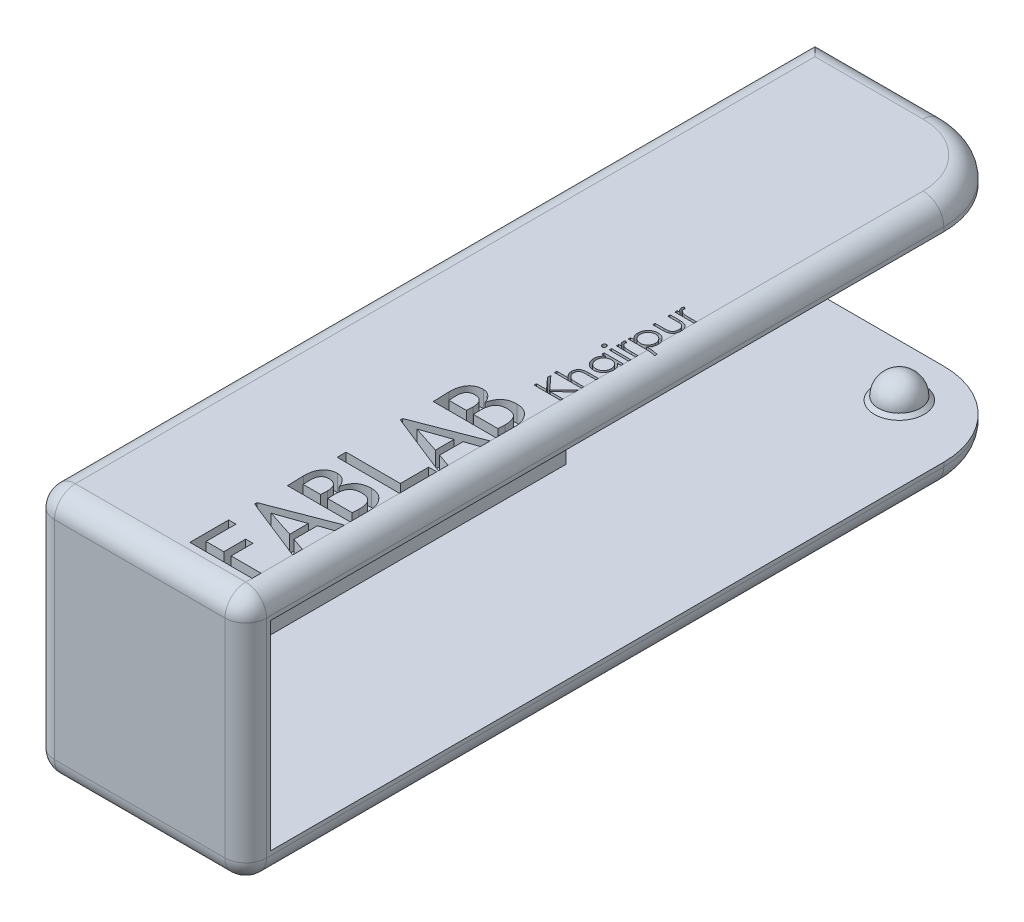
from build123d import *
from build123d.topology import SkipClean

# Parameters (mm, degrees)
SKETCH9_W            = 28.5
SKETCH9_H            = 30
SKETCH9_W_2          = 22.5
SKETCH9_H_2          = 24
EXTRUDE_THIN5_DEPTH  = 91
SKETCH10_W           = 28.5
SKETCH10_H           = 30
BOSS_EXTRUDE3_DEPTH  = 3
SKETCH14_W           = 94
SKETCH14_H           = 30
CUT_EXTRUDE6_DEPTH   = 3
SKETCH16_W           = 32.96402296
SKETCH16_H           = 24
CUT_EXTRUDE8_DEPTH   = 3
SKETCH35_R           = 3
BOSS_EXTRUDE12_DEPTH = 0.4
BOSS_EXTRUDE12_TAPER = 50
REVOLVE6_ANGLE       = 180
FILLET5_R            = 10
FILLET6_R            = 2.5
CUT_REVOLVE12_ANGLE  = 180
SKETCH39_W           = 2.320192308
SKETCH39_H           = 0.284935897
CUT_EXTRUDE12_DEPTH  = 2
SKETCH17_R           = 3
BOSS_EXTRUDE13_DEPTH = 0.4
BOSS_EXTRUDE13_TAPER = 50
REVOLVE8_ANGLE       = 180


with BuildPart() as part:
    # Sketch9 → Extrude-Thin5 (new body)
    with BuildSketch(Plane.XY):
        with Locations((11.25, 12)):
            Rectangle(SKETCH9_W, SKETCH9_H)
        with Locations((11.25, 12)):
            Rectangle(SKETCH9_W_2, SKETCH9_H_2, mode=Mode.SUBTRACT)
    extrude(amount=-EXTRUDE_THIN5_DEPTH)

    # Sketch10 → Boss-Extrude3 (add)
    with BuildSketch(Plane.XY):
        with Locations((11.25, 12)):
            Rectangle(SKETCH10_W, SKETCH10_H)
    extrude(amount=BOSS_EXTRUDE3_DEPTH)

    # Sketch14 → Cut-Extrude6 (cut)
    with BuildSketch(Plane(origin=(25.5, 0, 0), x_dir=(0, 0, -1), z_dir=(1, 0, 0))):
        with Locations((44, 12)):
            Rectangle(SKETCH14_W, SKETCH14_H)
    extrude(amount=-CUT_EXTRUDE6_DEPTH, mode=Mode.SUBTRACT)

    # Sketch16 → Cut-Extrude8 (cut)
    with BuildSketch(Plane(origin=(0, 0, 0), x_dir=(0, 0, -1), z_dir=(1, 0, 0))):
        with Locations((74.51798852, 12)):
            Rectangle(SKETCH16_W, SKETCH16_H)
    extrude(amount=-CUT_EXTRUDE8_DEPTH, mode=Mode.SUBTRACT)

    # Sketch35 → Boss-Extrude12 (add)
    with BuildSketch(Plane.XZ.offset(-24)):
        with Locations((13.35, -84.8)):
            Circle(SKETCH35_R)
    extrude(amount=BOSS_EXTRUDE12_DEPTH, taper=BOSS_EXTRUDE12_TAPER)

    # Sketch36 → Revolve6 (revolve)
    with SkipClean():  # the faces are left unmerged after this step: merging them gives an invalid solid
        with BuildSketch(Plane.XZ.offset(-23.6)):
            with BuildLine():
                ThreePointArc((13.35, -82.276701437), (10.826701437, -84.8), (13.35, -87.323298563))
                Line((13.35, -87.323298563), (13.35, -82.276701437))
            make_face()
            with BuildLine():
                Line((13.35, -82.276701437), (13.35, -87.323298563))
                ThreePointArc((13.35, -87.323298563), (15.134241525, -86.584241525), (15.873298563, -84.8))
                ThreePointArc((15.873298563, -84.8), (15.134241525, -83.015758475), (13.35, -82.276701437))
            make_face()
        revolve(axis=Axis((13.35, 23.6, -87.323298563), (0, 0, 1)), revolution_arc=REVOLVE6_ANGLE)

    # Fillet5
    fillet5_edges = [part.edges().sort_by_distance(p)[0] for p in [
        (22.5, -1.5, -91),
        (22.5, 25.5, -91),
    ]]
    fillet(fillet5_edges, radius=FILLET5_R)

    # Fillet6
    fillet6_edges = [part.edges().sort_by_distance(p)[0] for p in [
        (-3, 12, 3),
        (9.75, -3, 3),
        (9.75, 27, 3),
        (22.5, 12, 3),
        (22.5, -3, -39),
        (-3, 27, -44),
        (-3, -3, -44),
        (-3, 12, -58.03597704),
        (4.75, -3, -91),
        (22.5, 27, -39),
        (19.571067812, -3, -88.071067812),
        (4.75, 27, -91),
        (19.571067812, 27, -88.071067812),
    ]]
    fillet(fillet6_edges, radius=FILLET6_R)

    # Sketch38 → Cut-Revolve12 (revolve, cut)
    with BuildSketch(Plane.XZ.offset(-24)):
        with BuildLine():
            ThreePointArc((16.044289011, -3.396853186), (15.840646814, -1.156789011), (18.080710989, -0.953146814))
            Line((18.080710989, -0.953146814), (16.044289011, -3.396853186))
        make_face()
    revolve(axis=Axis((18.080710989, 24, -0.953146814), (-0.6401843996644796, 0, -0.7682212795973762)), revolution_arc=CUT_REVOLVE12_ANGLE, mode=Mode.SUBTRACT)

    # Sketch39 → Cut-Extrude12 (cut)
    # profile 1 of 15: a face of its own
    with BuildSketch(Plane(origin=(0, 27, 0), x_dir=(1, 0, 0), z_dir=(0, 1, 0))):
        Polygon((13.376623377, 1.350649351), (15.519480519, 1.350649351), (15.519480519, 3.980519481), (16.396103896, 3.980519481), (16.396103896, 1.350649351), (20, 1.350649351), (20, 0.279220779), (12.5, 0.279220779), (12.5, 4.954545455), (13.376623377, 4.954545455), align=None)
    # profile 2 of 15: a face of its own
    with BuildSketch(Plane(origin=(0, 27, 0), x_dir=(1, 0, 0), z_dir=(0, 1, 0))):
        Polygon((20, 10.214285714), (18.441558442, 9.675527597), (18.441558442, 6.864549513), (20, 6.318181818), (20, 5.149350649), (12.402597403, 8.168831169), (12.402597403, 8.461038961), (20, 11.383116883), align=None)
        Polygon((14.350649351, 8.217532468), (17.662337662, 7.132406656), (17.662337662, 9.371144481), align=None, mode=Mode.SUBTRACT)
    # profile 3 of 15: a face of its own
    with BuildSketch(Plane(origin=(0, 27, 0), x_dir=(1, 0, 0), z_dir=(0, 1, 0))):
        with BuildLine():
            Line((20, 14.212357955), (20, 12.064935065))
            Line((20, 12.064935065), (12.469561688, 12.064935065))
            add(Edge.make_bspline(
                [(12.469561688, 12.064935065), (12.464445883, 12.174511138), (12.454593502, 12.385540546), (12.441047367, 12.690436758), (12.428222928, 12.971440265), (12.41971457, 13.22919536), (12.411345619, 13.463029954), (12.407267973, 13.673085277), (12.403918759, 13.85926438), (12.403018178, 13.975445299), (12.402597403, 14.029728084)],
                knots=[0, 0, 0, 0, 1.339051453, 2.578840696, 3.725557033, 4.772779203, 5.726954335, 6.58174599, 7.337354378, 8, 8, 8, 8], degree=3))
            add(Edge.make_bspline(
                [(12.402597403, 14.029728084), (12.404102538, 14.119563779), (12.407023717, 14.293917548), (12.428294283, 14.54764441), (12.464206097, 14.785807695), (12.516293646, 15.00846793), (12.580607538, 15.216323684), (12.662120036, 15.407497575), (12.756215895, 15.584065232), (12.866196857, 15.744096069), (12.989015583, 15.888311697), (13.126836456, 16.011677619), (13.27623691, 16.117017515), (13.438673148, 16.202046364), (13.613531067, 16.270143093), (13.80140843, 16.315853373), (14.001136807, 16.346335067), (14.13847513, 16.349184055), (14.209111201, 16.350649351)],
                knots=[0, 0, 0, 0, 1.293171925, 2.509797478, 3.662491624, 4.7572812, 5.798971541, 6.790532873, 7.744676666, 8.674473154, 9.580681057, 10.46496469, 11.330102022, 12.205626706, 13.09804565, 14.024422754, 14.983917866, 16, 16, 16, 16], degree=3))
            add(Edge.make_bspline(
                [(14.209111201, 16.350649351), (14.251292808, 16.349525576), (14.335040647, 16.34729442), (14.459313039, 16.327888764), (14.581256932, 16.298661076), (14.698938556, 16.252417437), (14.815488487, 16.199180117), (14.926303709, 16.128442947), (15.037176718, 16.050044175), (15.175467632, 15.927198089), (15.332394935, 15.762587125), (15.483867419, 15.547368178), (15.602392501, 15.323323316), (15.644636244, 15.163613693), (15.665584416, 15.084415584)],
                knots=[0, 0, 0, 0, 0.73324583, 1.455794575, 2.183444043, 2.909486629, 3.651546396, 4.40825657, 5.191959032, 6.011265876, 7.621841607, 9.134876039, 10.579218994, 12, 12, 12, 12], degree=3))
            add(Edge.make_bspline(
                [(15.665584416, 15.084415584), (15.68451075, 15.158218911), (15.721493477, 15.302433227), (15.789852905, 15.508922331), (15.867003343, 15.699939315), (15.954633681, 15.874623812), (16.049458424, 16.034847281), (16.155394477, 16.178278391), (16.268200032, 16.307921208), (16.392213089, 16.421347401), (16.527720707, 16.519150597), (16.673028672, 16.604486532), (16.828732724, 16.678759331), (16.99773101, 16.735659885), (17.177394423, 16.781139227), (17.368586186, 16.814737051), (17.571101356, 16.834668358), (17.709978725, 16.836648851), (17.781047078, 16.837662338)],
                knots=[0, 0, 0, 0, 1.208997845, 2.362424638, 3.449441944, 4.475685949, 5.461623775, 6.400508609, 7.301874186, 8.185258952, 9.061385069, 9.949308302, 10.856981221, 11.794034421, 12.774367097, 13.796306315, 14.872293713, 16, 16, 16, 16], degree=3))
            add(Edge.make_bspline(
                [(17.781047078, 16.837662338), (17.863371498, 16.835987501), (18.024749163, 16.832704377), (18.259712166, 16.796062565), (18.482352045, 16.740254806), (18.692488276, 16.661408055), (18.888147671, 16.556241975), (19.072353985, 16.430848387), (19.243619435, 16.282403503), (19.399649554, 16.111473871), (19.540601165, 15.923257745), (19.664735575, 15.720281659), (19.768015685, 15.502605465), (19.854183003, 15.271694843), (19.918549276, 15.026215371), (19.965708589, 14.767284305), (19.99543927, 14.494605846), (19.998457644, 14.307809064), (20, 14.212357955)],
                knots=[0, 0, 0, 0, 1.021251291, 2.00192299, 2.944416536, 3.867325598, 4.780187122, 5.695565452, 6.628732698, 7.587065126, 8.56327736, 9.544050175, 10.535642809, 11.549956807, 12.599500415, 13.681645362, 14.815346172, 16, 16, 16, 16], degree=3))
        make_face()
        with BuildLine():
            Line((13.279220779, 13.136363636), (15.390117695, 13.136363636))
            add(Edge.make_bspline(
                [(15.390117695, 13.136363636), (15.394951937, 13.190624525), (15.405152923, 13.305123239), (15.415563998, 13.485782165), (15.42165637, 13.684717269), (15.421933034, 13.823250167), (15.422077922, 13.895799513)],
                knots=[0, 0, 0, 0, 0.859626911, 1.813943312, 2.855167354, 4, 4, 4, 4], degree=3))
            add(Edge.make_bspline(
                [(15.422077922, 13.895799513), (15.421261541, 13.951633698), (15.419678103, 14.05992868), (15.405786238, 14.217021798), (15.383452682, 14.36359113), (15.351427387, 14.498824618), (15.312151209, 14.624068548), (15.262467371, 14.738114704), (15.201758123, 14.840691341), (15.13584574, 14.935045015), (15.05688608, 15.015988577), (14.969784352, 15.086107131), (14.874171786, 15.146745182), (14.768926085, 15.19473139), (14.655232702, 15.233064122), (14.532411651, 15.260830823), (14.400191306, 15.275039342), (14.309079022, 15.277803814), (14.262378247, 15.279220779)],
                knots=[0, 0, 0, 0, 1.296828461, 2.515305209, 3.660389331, 4.738053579, 5.740607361, 6.706255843, 7.619875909, 8.506259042, 9.373075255, 10.236278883, 11.09948251, 11.995837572, 12.91634841, 13.882715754, 14.914758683, 16, 16, 16, 16], degree=3))
            add(Edge.make_bspline(
                [(14.262378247, 15.279220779), (14.221228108, 15.278553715), (14.141161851, 15.277255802), (14.025116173, 15.261169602), (13.916676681, 15.237801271), (13.816383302, 15.20257301), (13.725322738, 15.156091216), (13.639551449, 15.103130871), (13.56378457, 15.037271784), (13.496571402, 14.961224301), (13.434584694, 14.87766376), (13.383300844, 14.781893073), (13.33903651, 14.677062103), (13.304446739, 14.562074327), (13.277663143, 14.437795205), (13.255110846, 14.303899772), (13.246172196, 14.159207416), (13.243876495, 14.059661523), (13.242694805, 14.008421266)],
                knots=[0, 0, 0, 0, 1.059624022, 2.06172158, 3.013167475, 3.914528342, 4.791479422, 5.643722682, 6.505834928, 7.366756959, 8.255804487, 9.18019209, 10.158646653, 11.184175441, 12.26890402, 13.433779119, 14.679063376, 16, 16, 16, 16], degree=3))
            add(Edge.make_bspline(
                [(13.242694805, 14.008421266), (13.243547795, 13.929281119), (13.245204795, 13.77554513), (13.250293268, 13.551191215), (13.263077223, 13.339655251), (13.273944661, 13.202804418), (13.279220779, 13.136363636)],
                knots=[0, 0, 0, 0, 1.087806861, 2.11315079, 3.083938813, 4, 4, 4, 4], degree=3))
        make_face(mode=Mode.SUBTRACT)
        with BuildLine():
            Line((16.227171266, 13.136363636), (19.169034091, 13.136363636))
            add(Edge.make_bspline(
                [(19.169034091, 13.136363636), (19.176844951, 13.218528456), (19.191445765, 13.372118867), (19.20895339, 13.587671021), (19.218444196, 13.77243648), (19.220051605, 13.885645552), (19.220779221, 13.936891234)],
                knots=[0, 0, 0, 0, 1.234185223, 2.307058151, 3.233666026, 4, 4, 4, 4], degree=3))
            add(Edge.make_bspline(
                [(19.220779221, 13.936891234), (19.219538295, 14.013522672), (19.217135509, 14.161902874), (19.200804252, 14.376472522), (19.172237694, 14.575393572), (19.131627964, 14.757615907), (19.079665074, 14.924307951), (19.016532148, 15.075289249), (18.940243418, 15.210126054), (18.852174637, 15.328994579), (18.752976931, 15.434764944), (18.636757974, 15.522171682), (18.510256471, 15.599967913), (18.367692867, 15.660052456), (18.212557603, 15.709522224), (18.042779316, 15.741066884), (17.860307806, 15.764067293), (17.733950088, 15.765493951), (17.668425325, 15.766233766)],
                knots=[0, 0, 0, 0, 1.32816977, 2.571713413, 3.726913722, 4.808420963, 5.803983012, 6.749560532, 7.639497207, 8.481858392, 9.308983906, 10.142626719, 10.994615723, 11.876699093, 12.81665923, 13.811638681, 14.865191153, 16, 16, 16, 16], degree=3))
            add(Edge.make_bspline(
                [(17.668425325, 15.766233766), (17.608002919, 15.765224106), (17.490362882, 15.763258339), (17.320152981, 15.743537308), (17.162267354, 15.71001276), (17.016949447, 15.664337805), (16.882632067, 15.607109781), (16.762170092, 15.533101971), (16.653200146, 15.44745437), (16.55560089, 15.348973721), (16.470873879, 15.234078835), (16.397961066, 15.102586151), (16.337287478, 14.953142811), (16.287534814, 14.786422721), (16.248096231, 14.602239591), (16.221772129, 14.400677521), (16.204727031, 14.18221151), (16.202470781, 14.030777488), (16.201298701, 13.95211039)],
                knots=[0, 0, 0, 0, 1.076720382, 2.096332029, 3.048766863, 3.949665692, 4.808175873, 5.64409988, 6.461825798, 7.27393223, 8.107701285, 8.998329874, 9.947151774, 10.977017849, 12.096191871, 13.300910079, 14.597874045, 16, 16, 16, 16], degree=3))
            Line((16.201298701, 13.95211039), (16.227171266, 13.136363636))
        make_face(mode=Mode.SUBTRACT)
    # profile 4 of 15: a face of its own
    with BuildSketch(Plane(origin=(0, 27, 0), x_dir=(1, 0, 0), z_dir=(0, 1, 0))):
        Polygon((20, 18.006493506), (12.5, 18.006493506), (12.5, 19.077922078), (19.025974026, 19.077922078), (19.025974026, 22.487012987), (20, 22.487012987), align=None)
    # profile 5 of 15: a face of its own
    with BuildSketch(Plane(origin=(0, 27, 0), x_dir=(1, 0, 0), z_dir=(0, 1, 0))):
        Polygon((20, 27.746753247), (18.441558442, 27.20799513), (18.441558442, 24.397017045), (20, 23.850649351), (20, 22.681818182), (12.402597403, 25.701298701), (12.402597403, 25.993506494), (20, 28.915584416), align=None)
        Polygon((14.350649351, 25.75), (17.662337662, 24.664874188), (17.662337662, 26.903612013), align=None, mode=Mode.SUBTRACT)
    # profile 6 of 15: a face of its own
    with BuildSketch(Plane(origin=(0, 27, 0), x_dir=(1, 0, 0), z_dir=(0, 1, 0))):
        with BuildLine():
            Line((20, 31.744825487), (20, 29.597402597))
            Line((20, 29.597402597), (12.469561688, 29.597402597))
            add(Edge.make_bspline(
                [(12.469561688, 29.597402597), (12.464445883, 29.70697867), (12.454593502, 29.918008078), (12.441047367, 30.22290429), (12.428222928, 30.503907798), (12.41971457, 30.761662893), (12.411345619, 30.995497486), (12.407267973, 31.205552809), (12.403918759, 31.391731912), (12.403018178, 31.507912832), (12.402597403, 31.562195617)],
                knots=[0, 0, 0, 0, 1.339051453, 2.578840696, 3.725557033, 4.772779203, 5.726954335, 6.58174599, 7.337354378, 8, 8, 8, 8], degree=3))
            add(Edge.make_bspline(
                [(12.402597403, 31.562195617), (12.404102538, 31.652031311), (12.407023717, 31.82638508), (12.428294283, 32.080111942), (12.464206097, 32.318275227), (12.516293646, 32.540935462), (12.580607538, 32.748791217), (12.662120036, 32.939965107), (12.756215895, 33.116532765), (12.866196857, 33.276563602), (12.989015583, 33.420779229), (13.126836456, 33.544145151), (13.27623691, 33.649485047), (13.438673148, 33.734513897), (13.613531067, 33.802610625), (13.80140843, 33.848320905), (14.001136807, 33.8788026), (14.13847513, 33.881651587), (14.209111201, 33.883116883)],
                knots=[0, 0, 0, 0, 1.293171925, 2.509797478, 3.662491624, 4.7572812, 5.798971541, 6.790532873, 7.744676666, 8.674473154, 9.580681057, 10.46496469, 11.330102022, 12.205626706, 13.09804565, 14.024422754, 14.983917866, 16, 16, 16, 16], degree=3))
            add(Edge.make_bspline(
                [(14.209111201, 33.883116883), (14.251292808, 33.881993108), (14.335040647, 33.879761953), (14.459313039, 33.860356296), (14.581256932, 33.831128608), (14.698938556, 33.784884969), (14.815488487, 33.73164765), (14.926303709, 33.660910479), (15.037176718, 33.582511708), (15.175467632, 33.459665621), (15.332394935, 33.295054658), (15.483867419, 33.07983571), (15.602392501, 32.855790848), (15.644636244, 32.696081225), (15.665584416, 32.616883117)],
                knots=[0, 0, 0, 0, 0.73324583, 1.455794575, 2.183444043, 2.909486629, 3.651546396, 4.40825657, 5.191959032, 6.011265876, 7.621841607, 9.134876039, 10.579218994, 12, 12, 12, 12], degree=3))
            add(Edge.make_bspline(
                [(15.665584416, 32.616883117), (15.68451075, 32.690686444), (15.721493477, 32.83490076), (15.789852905, 33.041389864), (15.867003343, 33.232406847), (15.954633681, 33.407091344), (16.049458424, 33.567314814), (16.155394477, 33.710745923), (16.268200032, 33.840388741), (16.392213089, 33.953814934), (16.527720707, 34.05161813), (16.673028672, 34.136954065), (16.828732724, 34.211226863), (16.99773101, 34.268127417), (17.177394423, 34.31360676), (17.368586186, 34.347204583), (17.571101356, 34.36713589), (17.709978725, 34.369116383), (17.781047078, 34.37012987)],
                knots=[0, 0, 0, 0, 1.208997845, 2.362424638, 3.449441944, 4.475685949, 5.461623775, 6.400508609, 7.301874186, 8.185258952, 9.061385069, 9.949308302, 10.856981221, 11.794034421, 12.774367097, 13.796306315, 14.872293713, 16, 16, 16, 16], degree=3))
            add(Edge.make_bspline(
                [(17.781047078, 34.37012987), (17.863371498, 34.368455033), (18.024749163, 34.365171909), (18.259712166, 34.328530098), (18.482352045, 34.272722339), (18.692488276, 34.193875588), (18.888147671, 34.088709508), (19.072353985, 33.963315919), (19.243619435, 33.814871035), (19.399649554, 33.643941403), (19.540601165, 33.455725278), (19.664735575, 33.252749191), (19.768015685, 33.035072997), (19.854183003, 32.804162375), (19.918549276, 32.558682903), (19.965708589, 32.299751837), (19.99543927, 32.027073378), (19.998457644, 31.840276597), (20, 31.744825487)],
                knots=[0, 0, 0, 0, 1.021251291, 2.00192299, 2.944416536, 3.867325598, 4.780187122, 5.695565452, 6.628732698, 7.587065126, 8.56327736, 9.544050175, 10.535642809, 11.549956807, 12.599500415, 13.681645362, 14.815346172, 16, 16, 16, 16], degree=3))
        make_face()
        with BuildLine():
            Line((13.279220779, 30.668831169), (15.390117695, 30.668831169))
            add(Edge.make_bspline(
                [(15.390117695, 30.668831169), (15.394951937, 30.723092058), (15.405152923, 30.837590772), (15.415563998, 31.018249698), (15.42165637, 31.217184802), (15.421933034, 31.355717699), (15.422077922, 31.428267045)],
                knots=[0, 0, 0, 0, 0.859626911, 1.813943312, 2.855167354, 4, 4, 4, 4], degree=3))
            add(Edge.make_bspline(
                [(15.422077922, 31.428267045), (15.421261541, 31.48410123), (15.419678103, 31.592396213), (15.405786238, 31.74948933), (15.383452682, 31.896058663), (15.351427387, 32.03129215), (15.312151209, 32.15653608), (15.262467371, 32.270582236), (15.201758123, 32.373158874), (15.13584574, 32.467512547), (15.05688608, 32.54845611), (14.969784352, 32.618574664), (14.874171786, 32.679212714), (14.768926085, 32.727198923), (14.655232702, 32.765531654), (14.532411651, 32.793298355), (14.400191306, 32.807506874), (14.309079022, 32.810271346), (14.262378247, 32.811688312)],
                knots=[0, 0, 0, 0, 1.296828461, 2.515305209, 3.660389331, 4.738053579, 5.740607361, 6.706255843, 7.619875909, 8.506259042, 9.373075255, 10.236278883, 11.09948251, 11.995837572, 12.91634841, 13.882715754, 14.914758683, 16, 16, 16, 16], degree=3))
            add(Edge.make_bspline(
                [(14.262378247, 32.811688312), (14.221228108, 32.811021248), (14.141161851, 32.809723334), (14.025116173, 32.793637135), (13.916676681, 32.770268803), (13.816383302, 32.735040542), (13.725322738, 32.688558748), (13.639551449, 32.635598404), (13.56378457, 32.569739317), (13.496571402, 32.493691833), (13.434584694, 32.410131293), (13.383300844, 32.314360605), (13.33903651, 32.209529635), (13.304446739, 32.09454186), (13.277663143, 31.970262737), (13.255110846, 31.836367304), (13.246172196, 31.691674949), (13.243876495, 31.592129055), (13.242694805, 31.540888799)],
                knots=[0, 0, 0, 0, 1.059624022, 2.06172158, 3.013167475, 3.914528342, 4.791479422, 5.643722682, 6.505834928, 7.366756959, 8.255804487, 9.18019209, 10.158646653, 11.184175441, 12.26890402, 13.433779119, 14.679063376, 16, 16, 16, 16], degree=3))
            add(Edge.make_bspline(
                [(13.242694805, 31.540888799), (13.243547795, 31.461748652), (13.245204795, 31.308012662), (13.250293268, 31.083658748), (13.263077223, 30.872122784), (13.273944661, 30.735271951), (13.279220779, 30.668831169)],
                knots=[0, 0, 0, 0, 1.087806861, 2.11315079, 3.083938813, 4, 4, 4, 4], degree=3))
        make_face(mode=Mode.SUBTRACT)
        with BuildLine():
            Line((16.227171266, 30.668831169), (19.169034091, 30.668831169))
            add(Edge.make_bspline(
                [(19.169034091, 30.668831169), (19.176844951, 30.750995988), (19.191445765, 30.904586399), (19.20895339, 31.120138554), (19.218444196, 31.304904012), (19.220051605, 31.418113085), (19.220779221, 31.469358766)],
                knots=[0, 0, 0, 0, 1.234185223, 2.307058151, 3.233666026, 4, 4, 4, 4], degree=3))
            add(Edge.make_bspline(
                [(19.220779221, 31.469358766), (19.219538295, 31.545990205), (19.217135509, 31.694370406), (19.200804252, 31.908940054), (19.172237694, 32.107861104), (19.131627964, 32.290083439), (19.079665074, 32.456775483), (19.016532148, 32.607756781), (18.940243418, 32.742593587), (18.852174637, 32.861462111), (18.752976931, 32.967232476), (18.636757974, 33.054639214), (18.510256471, 33.132435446), (18.367692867, 33.192519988), (18.212557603, 33.241989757), (18.042779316, 33.273534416), (17.860307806, 33.296534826), (17.733950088, 33.297961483), (17.668425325, 33.298701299)],
                knots=[0, 0, 0, 0, 1.32816977, 2.571713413, 3.726913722, 4.808420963, 5.803983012, 6.749560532, 7.639497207, 8.481858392, 9.308983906, 10.142626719, 10.994615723, 11.876699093, 12.81665923, 13.811638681, 14.865191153, 16, 16, 16, 16], degree=3))
            add(Edge.make_bspline(
                [(17.668425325, 33.298701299), (17.608002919, 33.297691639), (17.490362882, 33.295725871), (17.320152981, 33.276004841), (17.162267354, 33.242480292), (17.016949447, 33.196805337), (16.882632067, 33.139577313), (16.762170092, 33.065569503), (16.653200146, 32.979921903), (16.55560089, 32.881441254), (16.470873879, 32.766546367), (16.397961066, 32.635053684), (16.337287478, 32.485610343), (16.287534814, 32.318890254), (16.248096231, 32.134707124), (16.221772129, 31.933145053), (16.204727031, 31.714679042), (16.202470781, 31.56324502), (16.201298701, 31.484577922)],
                knots=[0, 0, 0, 0, 1.076720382, 2.096332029, 3.048766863, 3.949665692, 4.808175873, 5.64409988, 6.461825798, 7.27393223, 8.107701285, 8.998329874, 9.947151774, 10.977017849, 12.096191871, 13.300910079, 14.597874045, 16, 16, 16, 16], degree=3))
            Line((16.201298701, 31.484577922), (16.227171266, 30.668831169))
        make_face(mode=Mode.SUBTRACT)
    # profile 7 of 15: a face of its own
    with BuildSketch(Plane(origin=(0, 27, 0), x_dir=(1, 0, 0), z_dir=(0, 1, 0))):
        Polygon((16.825, 37.380288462), (16.825, 37.665224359), (18.034069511, 37.665224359), (16.825, 38.988777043), (16.825, 39.395192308), (18.249679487, 37.835041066), (20, 39.517307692), (20, 39.137605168), (18.467833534, 37.665224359), (20, 37.665224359), (20, 37.380288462), align=None)
    # profile 8 of 15: a face of its own
    with BuildSketch(Plane(origin=(0, 27, 0), x_dir=(1, 0, 0), z_dir=(0, 1, 0))):
        with BuildLine():
            Line((16.743589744, 39.90400641), (16.743589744, 40.188942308))
            Line((16.743589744, 40.188942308), (18.118023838, 40.188942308))
            add(Edge.make_bspline(
                [(18.118023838, 40.188942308), (18.079797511, 40.219531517), (18.005368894, 40.279090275), (17.908190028, 40.379287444), (17.824146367, 40.482444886), (17.756355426, 40.591258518), (17.703324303, 40.704778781), (17.666746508, 40.823168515), (17.643423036, 40.945950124), (17.640555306, 41.029440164), (17.639102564, 41.071734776)],
                knots=[0, 0, 0, 0, 1.125633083, 2.191665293, 3.205031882, 4.182434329, 5.134135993, 6.080017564, 7.027370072, 8, 8, 8, 8], degree=3))
            add(Edge.make_bspline(
                [(17.639102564, 41.071734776), (17.640593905, 41.114692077), (17.643514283, 41.198812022), (17.669320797, 41.320829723), (17.709921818, 41.435487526), (17.767569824, 41.541096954), (17.838766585, 41.636519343), (17.921823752, 41.720039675), (18.016753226, 41.789513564), (18.104967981, 41.836063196), (18.183450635, 41.866544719), (18.250798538, 41.885817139), (18.32583767, 41.902164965), (18.408537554, 41.916406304), (18.49929268, 41.925898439), (18.597694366, 41.933522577), (18.70373674, 41.93894409), (18.777142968, 41.939154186), (18.815099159, 41.939262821)],
                knots=[0, 0, 0, 0, 1.235771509, 2.41991536, 3.57472251, 4.727526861, 5.870395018, 6.992794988, 8.106410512, 9.245194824, 9.854018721, 10.52826073, 11.259975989, 12.064917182, 12.943387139, 13.886414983, 14.90712766, 16, 16, 16, 16], degree=3))
            Line((18.815099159, 41.939262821), (20, 41.939262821))
            Line((20, 41.939262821), (20, 41.654326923))
            Line((20, 41.654326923), (18.90859375, 41.654326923))
            add(Edge.make_bspline(
                [(18.90859375, 41.654326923), (18.877004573, 41.654154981), (18.816579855, 41.653826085), (18.730069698, 41.652725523), (18.65181524, 41.650324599), (18.581654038, 41.646301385), (18.519681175, 41.64225309), (18.465795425, 41.636513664), (18.42033483, 41.629885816), (18.392971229, 41.623926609), (18.380699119, 41.621254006)],
                knots=[0, 0, 0, 0, 1.430934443, 2.737134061, 3.918973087, 4.976914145, 5.92044225, 6.731742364, 7.431207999, 8, 8, 8, 8], degree=3))
            add(Edge.make_bspline(
                [(18.380699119, 41.621254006), (18.344664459, 41.610938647), (18.275571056, 41.59115982), (18.181882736, 41.54427009), (18.101287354, 41.487064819), (18.036035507, 41.416170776), (17.98483484, 41.334061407), (17.94940251, 41.239834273), (17.927404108, 41.134442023), (17.92519164, 41.060190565), (17.924038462, 41.021489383)],
                knots=[0, 0, 0, 0, 1.090133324, 2.090238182, 3.036763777, 3.954757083, 4.878717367, 5.838952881, 6.873623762, 8, 8, 8, 8], degree=3))
            add(Edge.make_bspline(
                [(17.924038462, 41.021489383), (17.924463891, 40.998565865), (17.925305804, 40.953200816), (17.933972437, 40.885967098), (17.947660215, 40.820544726), (17.967878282, 40.757109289), (17.992459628, 40.69553139), (18.022625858, 40.63556072), (18.059100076, 40.578018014), (18.100151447, 40.522160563), (18.145565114, 40.470162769), (18.193506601, 40.421788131), (18.244555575, 40.378663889), (18.297895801, 40.339594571), (18.354258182, 40.305868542), (18.413099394, 40.276428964), (18.474496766, 40.251450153), (18.517109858, 40.239037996), (18.53843149, 40.232827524)],
                knots=[0, 0, 0, 0, 1.024369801, 2.02720137, 3.025498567, 4.008789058, 4.999724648, 5.987391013, 7.005161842, 8.042127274, 9.083588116, 10.088924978, 11.084112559, 12.068088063, 13.041783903, 14.016724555, 15.007660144, 16, 16, 16, 16], degree=3))
            add(Edge.make_bspline(
                [(18.53843149, 40.232827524), (18.553871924, 40.229253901), (18.587518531, 40.221466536), (18.643012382, 40.213016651), (18.707497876, 40.205453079), (18.780877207, 40.199059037), (18.863419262, 40.19513738), (18.954560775, 40.19091169), (19.054872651, 40.189338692), (19.124627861, 40.189078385), (19.161092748, 40.188942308)],
                knots=[0, 0, 0, 0, 0.607992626, 1.324890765, 2.152360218, 3.099583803, 4.150613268, 5.323148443, 6.60066238, 8, 8, 8, 8], degree=3))
            Line((19.161092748, 40.188942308), (20, 40.188942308))
            Line((20, 40.188942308), (20, 39.90400641))
            Line((20, 39.90400641), (16.743589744, 39.90400641))
        make_face()
    # profile 9 of 15: a face of its own
    with BuildSketch(Plane(origin=(0, 27, 0), x_dir=(1, 0, 0), z_dir=(0, 1, 0))):
        with BuildLine():
            Line((17.679807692, 44.951442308), (20, 44.951442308))
            Line((20, 44.951442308), (20, 44.66650641))
            Line((20, 44.66650641), (19.598672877, 44.66650641))
            add(Edge.make_bspline(
                [(19.598672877, 44.66650641), (19.63493466, 44.634326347), (19.705805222, 44.57143316), (19.799241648, 44.467379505), (19.87489951, 44.355711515), (19.936891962, 44.239231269), (19.983270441, 44.116797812), (20.016294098, 43.989051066), (20.037511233, 43.855868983), (20.039630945, 43.764926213), (20.040705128, 43.718840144)],
                knots=[0, 0, 0, 0, 1.074325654, 2.099677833, 3.090439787, 4.057542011, 5.018572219, 5.985274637, 6.979019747, 8, 8, 8, 8], degree=3))
            add(Edge.make_bspline(
                [(20.040705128, 43.718840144), (20.039592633, 43.677866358), (20.037398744, 43.597064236), (20.020378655, 43.478202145), (19.993045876, 43.363818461), (19.955035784, 43.253805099), (19.904616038, 43.148873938), (19.844253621, 43.048126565), (19.772370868, 42.952084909), (19.690194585, 42.86221287), (19.600936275, 42.779452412), (19.505735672, 42.706825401), (19.405004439, 42.646270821), (19.300017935, 42.595634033), (19.189967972, 42.556630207), (19.075235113, 42.529439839), (18.955955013, 42.512439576), (18.874729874, 42.510246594), (18.83354367, 42.509134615)],
                knots=[0, 0, 0, 0, 1.033919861, 2.038935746, 3.024066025, 3.998881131, 4.97069526, 5.957263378, 6.95902576, 7.993208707, 9.027059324, 10.027763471, 11.009749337, 11.988697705, 12.965288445, 13.950418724, 14.960734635, 16, 16, 16, 16], degree=3))
            add(Edge.make_bspline(
                [(18.83354367, 42.509134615), (18.793208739, 42.510271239), (18.713468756, 42.512518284), (18.596194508, 42.52925799), (18.483238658, 42.557407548), (18.374964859, 42.596911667), (18.271242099, 42.647568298), (18.17199702, 42.709188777), (18.076956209, 42.781777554), (17.988354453, 42.865463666), (17.906511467, 42.956118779), (17.835383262, 43.053100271), (17.773954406, 43.153995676), (17.725283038, 43.260369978), (17.685904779, 43.370648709), (17.658660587, 43.485813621), (17.642606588, 43.605385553), (17.640281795, 43.686566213), (17.639102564, 43.727744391)],
                knots=[0, 0, 0, 0, 1.020392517, 2.01726096, 2.990465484, 3.961182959, 4.928053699, 5.906110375, 6.912531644, 7.948652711, 8.985773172, 9.998621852, 10.987621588, 11.969261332, 12.953316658, 13.946091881, 14.958173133, 16, 16, 16, 16], degree=3))
            add(Edge.make_bspline(
                [(17.639102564, 43.727744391), (17.640408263, 43.775096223), (17.642968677, 43.867950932), (17.664232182, 44.003788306), (17.700264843, 44.132233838), (17.748940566, 44.254651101), (17.814977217, 44.369355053), (17.895948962, 44.477773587), (17.995203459, 44.577600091), (18.070490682, 44.636358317), (18.109119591, 44.66650641)],
                knots=[0, 0, 0, 0, 1.039007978, 2.037445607, 3.008437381, 3.96246474, 4.921201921, 5.904967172, 6.925065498, 8, 8, 8, 8], degree=3))
            Line((18.109119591, 44.66650641), (17.679807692, 44.66650641))
            Line((17.679807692, 44.66650641), (17.679807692, 44.951442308))
        make_face()
        with BuildLine():
            add(Edge.make_bspline(
                [(17.924038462, 43.731560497), (17.925521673, 43.68991053), (17.928449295, 43.607700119), (17.95126691, 43.48699724), (17.989331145, 43.371554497), (18.041083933, 43.261551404), (18.107394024, 43.160055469), (18.185519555, 43.067754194), (18.276779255, 42.987493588), (18.377907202, 42.91846966), (18.486920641, 42.863058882), (18.600840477, 42.823848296), (18.717695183, 42.798036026), (18.796944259, 42.795395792), (18.836723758, 42.794070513)],
                knots=[0, 0, 0, 0, 1.031130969, 2.035288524, 3.029955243, 4.035265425, 5.037320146, 6.024362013, 7.021230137, 8.037832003, 9.049975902, 10.039737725, 11.016035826, 12, 12, 12, 12], degree=3))
            add(Edge.make_bspline(
                [(18.836723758, 42.794070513), (18.876263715, 42.795769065), (18.955188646, 42.79915951), (19.072033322, 42.823283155), (19.185697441, 42.86428558), (19.295586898, 42.919621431), (19.397702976, 42.989457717), (19.490601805, 43.06964199), (19.569949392, 43.16238735), (19.636419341, 43.264790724), (19.690079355, 43.374209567), (19.727424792, 43.48926339), (19.751534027, 43.607805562), (19.754350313, 43.688407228), (19.755769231, 43.729016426)],
                knots=[0, 0, 0, 0, 0.979154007, 1.954470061, 2.941101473, 3.965068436, 4.993389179, 5.998216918, 6.996159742, 8.005560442, 9.015493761, 10.005250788, 10.994993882, 12, 12, 12, 12], degree=3))
            add(Edge.make_bspline(
                [(19.755769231, 43.729016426), (19.75424601, 43.770237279), (19.751216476, 43.852221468), (19.728527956, 43.97341723), (19.689621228, 44.090629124), (19.63733461, 44.20305758), (19.572210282, 44.307691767), (19.495967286, 44.401284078), (19.407906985, 44.481359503), (19.31000334, 44.548028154), (19.203356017, 44.600899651), (19.089927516, 44.639558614), (18.969487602, 44.662161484), (18.887064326, 44.665038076), (18.844991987, 44.66650641)],
                knots=[0, 0, 0, 0, 1.01787422, 2.024450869, 3.03297362, 4.061474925, 5.080076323, 6.069755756, 7.033548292, 8.009625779, 8.9862229, 9.964937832, 10.961217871, 12, 12, 12, 12], degree=3))
            add(Edge.make_bspline(
                [(18.844991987, 44.66650641), (18.812935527, 44.665635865), (18.749838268, 44.663922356), (18.65719402, 44.650831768), (18.568535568, 44.63000837), (18.4837697, 44.600665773), (18.403365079, 44.562120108), (18.326744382, 44.515631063), (18.254306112, 44.46038112), (18.187047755, 44.397259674), (18.125700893, 44.328166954), (18.070941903, 44.255056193), (18.025957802, 44.177061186), (17.988727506, 44.095493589), (17.959100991, 44.010211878), (17.93933644, 43.920522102), (17.925765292, 43.827377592), (17.924620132, 43.763835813), (17.924038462, 43.731560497)],
                knots=[0, 0, 0, 0, 1.050140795, 2.067009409, 3.05949893, 4.030605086, 5.00011959, 5.97591094, 6.962425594, 7.979863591, 8.993523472, 9.986985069, 10.967611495, 11.937549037, 12.921786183, 13.919465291, 14.943216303, 16, 16, 16, 16], degree=3))
        make_face(mode=Mode.SUBTRACT)
    # profile 10 of 15: a face of its own
    with BuildSketch(Plane(origin=(0, 27, 0), x_dir=(1, 0, 0), z_dir=(0, 1, 0))):
        with BuildLine():
            add(Edge.make_bspline(
                [(16.702884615, 45.703215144), (16.703704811, 45.720896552), (16.705310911, 45.755520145), (16.719064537, 45.805588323), (16.742377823, 45.851178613), (16.773655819, 45.891616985), (16.810439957, 45.926316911), (16.853312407, 45.950610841), (16.899629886, 45.966224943), (16.93193786, 45.968110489), (16.94838742, 45.969070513)],
                knots=[0, 0, 0, 0, 1.055194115, 2.066272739, 3.074728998, 4.095836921, 5.109056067, 6.073838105, 7.019297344, 8, 8, 8, 8], degree=3))
            add(Edge.make_bspline(
                [(16.94838742, 45.969070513), (16.96440997, 45.968088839), (16.996084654, 45.966148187), (17.041599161, 45.950622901), (17.083875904, 45.926109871), (17.120588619, 45.891639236), (17.151849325, 45.851172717), (17.175167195, 45.80558989), (17.188919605, 45.755519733), (17.190525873, 45.720896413), (17.191346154, 45.703215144)],
                knots=[0, 0, 0, 0, 0.96129708, 1.900370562, 2.859976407, 3.87933698, 4.906634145, 5.921202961, 6.938410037, 8, 8, 8, 8], degree=3))
            add(Edge.make_bspline(
                [(17.191346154, 45.703215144), (17.190557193, 45.685736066), (17.189021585, 45.651715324), (17.174897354, 45.602396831), (17.151841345, 45.557195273), (17.120793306, 45.516678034), (17.083650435, 45.482904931), (17.041624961, 45.458322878), (16.996078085, 45.442833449), (16.964407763, 45.440887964), (16.94838742, 45.439903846)],
                knots=[0, 0, 0, 0, 1.054934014, 2.053291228, 3.073705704, 4.106921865, 5.123545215, 6.088680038, 7.033164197, 8, 8, 8, 8], degree=3))
            add(Edge.make_bspline(
                [(16.94838742, 45.439903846), (16.931940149, 45.440866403), (16.899636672, 45.442756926), (16.853286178, 45.458334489), (16.810667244, 45.482700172), (16.773451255, 45.516700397), (16.742385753, 45.557189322), (16.719334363, 45.602398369), (16.705208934, 45.651714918), (16.703673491, 45.685735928), (16.702884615, 45.703215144)],
                knots=[0, 0, 0, 0, 0.98631895, 1.937192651, 2.907499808, 3.917963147, 4.944918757, 5.95915025, 6.951458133, 8, 8, 8, 8], degree=3))
        make_face()
    # profile 11 of 15: a face of its own
    with BuildSketch(Plane(origin=(0, 27, 0), x_dir=(1, 0, 0), z_dir=(0, 1, 0))):
        with Locations((18.839903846, 45.70448718)):
            Rectangle(SKETCH39_W, SKETCH39_H)
    # profile 12 of 15: a face of its own
    with BuildSketch(Plane(origin=(0, 27, 0), x_dir=(1, 0, 0), z_dir=(0, 1, 0))):
        with BuildLine():
            Line((17.679807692, 46.416826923), (17.679807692, 46.701762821))
            Line((17.679807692, 46.701762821), (18.021349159, 46.701762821))
            add(Edge.make_bspline(
                [(18.021349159, 46.701762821), (17.989534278, 46.722784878), (17.928688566, 46.762989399), (17.848324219, 46.830126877), (17.781025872, 46.898162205), (17.728076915, 46.968881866), (17.688060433, 47.041592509), (17.659942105, 47.115681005), (17.642505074, 47.191328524), (17.640238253, 47.242287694), (17.639102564, 47.26781851)],
                knots=[0, 0, 0, 0, 1.280091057, 2.448164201, 3.510831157, 4.48793739, 5.405868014, 6.289422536, 7.142991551, 8, 8, 8, 8], degree=3))
            add(Edge.make_bspline(
                [(17.639102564, 47.26781851), (17.640182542, 47.287618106), (17.642404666, 47.328357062), (17.658017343, 47.390026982), (17.682943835, 47.453566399), (17.706384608, 47.494516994), (17.718604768, 47.515865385)],
                knots=[0, 0, 0, 0, 0.901110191, 1.854092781, 2.881294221, 4, 4, 4, 4], degree=3))
            Line((17.718604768, 47.515865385), (17.965379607, 47.359405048))
            add(Edge.make_bspline(
                [(17.965379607, 47.359405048), (17.959265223, 47.345699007), (17.947658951, 47.319682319), (17.933922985, 47.281623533), (17.925834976, 47.246534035), (17.924609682, 47.224178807), (17.924038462, 47.213757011)],
                knots=[0, 0, 0, 0, 1.180555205, 2.24091978, 3.179933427, 4, 4, 4, 4], degree=3))
            add(Edge.make_bspline(
                [(17.924038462, 47.213757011), (17.92555056, 47.190884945), (17.928634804, 47.14423256), (17.95322805, 47.07596885), (17.991820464, 47.00913476), (18.035765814, 46.956567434), (18.077979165, 46.915721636), (18.114925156, 46.886346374), (18.1567361, 46.859981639), (18.201795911, 46.834407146), (18.251235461, 46.810646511), (18.305135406, 46.789412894), (18.363050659, 46.769555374), (18.403320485, 46.758372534), (18.423948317, 46.752644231)],
                knots=[0, 0, 0, 0, 1.125322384, 2.295331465, 3.535939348, 4.916963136, 5.656144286, 6.429838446, 7.238666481, 8.090384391, 8.983239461, 9.940052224, 10.944811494, 12, 12, 12, 12], degree=3))
            add(Edge.make_bspline(
                [(18.423948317, 46.752644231), (18.442341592, 46.748343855), (18.483285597, 46.738771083), (18.551663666, 46.729711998), (18.632398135, 46.720400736), (18.725582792, 46.714042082), (18.831575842, 46.708035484), (18.949920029, 46.704717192), (19.080940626, 46.701868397), (19.172326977, 46.701799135), (19.220242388, 46.701762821)],
                knots=[0, 0, 0, 0, 0.566841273, 1.261806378, 2.068780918, 3.007109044, 4.065315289, 5.256255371, 6.561408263, 8, 8, 8, 8], degree=3))
            Line((19.220242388, 46.701762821), (20, 46.701762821))
            Line((20, 46.701762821), (20, 46.416826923))
            Line((20, 46.416826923), (17.679807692, 46.416826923))
        make_face()
    # profile 13 of 15: a face of its own
    with BuildSketch(Plane(origin=(0, 27, 0), x_dir=(1, 0, 0), z_dir=(0, 1, 0))):
        with BuildLine():
            Line((17.679807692, 47.84150641), (17.679807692, 48.126442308))
            Line((17.679807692, 48.126442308), (18.109119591, 48.126442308))
            add(Edge.make_bspline(
                [(18.109119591, 48.126442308), (18.070468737, 48.156789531), (17.9951201, 48.2159505), (17.896362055, 48.316374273), (17.814758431, 48.424270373), (17.748964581, 48.538958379), (17.700376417, 48.661166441), (17.664216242, 48.789147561), (17.642971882, 48.924359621), (17.640409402, 49.016792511), (17.639102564, 49.063932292)],
                knots=[0, 0, 0, 0, 1.07939028, 2.104237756, 3.085658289, 4.045737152, 5.001099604, 5.968961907, 6.964192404, 8, 8, 8, 8], degree=3))
            add(Edge.make_bspline(
                [(17.639102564, 49.063932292), (17.640293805, 49.10510896), (17.642648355, 49.186496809), (17.658589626, 49.306297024), (17.685910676, 49.421663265), (17.725281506, 49.531942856), (17.773954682, 49.638317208), (17.835383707, 49.739211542), (17.906509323, 49.83619741), (17.988362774, 49.926835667), (18.076925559, 50.010584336), (18.172195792, 50.083016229), (18.271040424, 50.145492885), (18.374991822, 50.195993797), (18.483231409, 50.235552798), (18.596196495, 50.263687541), (18.713468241, 50.280431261), (18.793208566, 50.282677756), (18.83354367, 50.283814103)],
                knots=[0, 0, 0, 0, 1.041296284, 2.058176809, 3.050446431, 4.034000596, 5.01514041, 6.003636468, 7.015969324, 8.052561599, 9.08815499, 10.094063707, 11.074456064, 12.040834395, 13.011057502, 13.983766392, 14.980127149, 16, 16, 16, 16], degree=3))
            add(Edge.make_bspline(
                [(18.83354367, 50.283814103), (18.87473005, 50.282702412), (18.955955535, 50.280509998), (19.075233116, 50.2635056), (19.189975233, 50.236330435), (19.299991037, 50.197270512), (19.405204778, 50.146795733), (19.50554058, 50.085378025), (19.600966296, 50.012909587), (19.690186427, 49.930086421), (19.772372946, 49.840231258), (19.844253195, 49.744185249), (19.904615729, 49.643438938), (19.955037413, 49.538507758), (19.993039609, 49.428493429), (20.020451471, 49.313909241), (20.037355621, 49.19481758), (20.039580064, 49.113808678), (20.040705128, 49.072836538)],
                knots=[0, 0, 0, 0, 1.038740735, 2.04854663, 3.033179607, 4.009277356, 4.987731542, 5.972001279, 6.972200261, 8.005528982, 9.039189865, 10.040446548, 11.026516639, 11.997840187, 12.972163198, 13.956796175, 14.96660207, 16, 16, 16, 16], degree=3))
            add(Edge.make_bspline(
                [(20.040705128, 49.072836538), (20.039438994, 49.026746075), (20.036938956, 48.935738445), (20.014749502, 48.802297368), (19.97830605, 48.674452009), (19.927197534, 48.552577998), (19.861557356, 48.436335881), (19.781654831, 48.326184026), (19.687503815, 48.221577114), (19.616083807, 48.158613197), (19.579592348, 48.126442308)],
                knots=[0, 0, 0, 0, 1.014661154, 2.003492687, 2.970165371, 3.937187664, 4.907406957, 5.904113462, 6.929124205, 8, 8, 8, 8], degree=3))
            Line((19.579592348, 48.126442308), (20.854807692, 48.126442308))
            Line((20.854807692, 48.126442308), (20.854807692, 47.84150641))
            Line((20.854807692, 47.84150641), (17.679807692, 47.84150641))
        make_face()
        with BuildLine():
            add(Edge.make_bspline(
                [(17.924038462, 49.061388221), (17.924619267, 49.029112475), (17.925762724, 48.965569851), (17.939346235, 48.87243148), (17.959065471, 48.7827192), (17.988921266, 48.697337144), (18.025568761, 48.615466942), (18.071363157, 48.537739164), (18.125476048, 48.46420837), (18.186870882, 48.395059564), (18.254520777, 48.332590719), (18.32671829, 48.277288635), (18.403371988, 48.230836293), (18.483767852, 48.192280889), (18.568536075, 48.162940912), (18.65719388, 48.142116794), (18.749838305, 48.129026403), (18.812935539, 48.127312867), (18.844991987, 48.126442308)],
                knots=[0, 0, 0, 0, 1.05670511, 2.080379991, 3.077984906, 4.06214886, 5.038337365, 6.01289324, 7.01187578, 8.025460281, 9.038092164, 10.024533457, 11.000252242, 11.969694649, 12.940728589, 13.933144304, 14.949937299, 16, 16, 16, 16], degree=3))
            add(Edge.make_bspline(
                [(18.844991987, 48.126442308), (18.887071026, 48.127891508), (18.969507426, 48.130730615), (19.089785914, 48.15359157), (19.203504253, 48.19121467), (19.309922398, 48.244407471), (19.408380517, 48.310852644), (19.495516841, 48.392362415), (19.572472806, 48.485906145), (19.637291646, 48.591221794), (19.689658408, 48.704225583), (19.728332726, 48.821703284), (19.751287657, 48.942830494), (19.754267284, 49.024615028), (19.755769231, 49.065840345)],
                knots=[0, 0, 0, 0, 1.037533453, 2.032615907, 3.008487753, 3.983910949, 4.958815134, 5.928528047, 6.917017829, 7.938835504, 8.970843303, 9.983125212, 10.983349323, 12, 12, 12, 12], degree=3))
            add(Edge.make_bspline(
                [(19.755769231, 49.065840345), (19.754357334, 49.106240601), (19.751554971, 49.186427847), (19.727300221, 49.304500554), (19.690245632, 49.419242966), (19.636225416, 49.528273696), (19.56998001, 49.630582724), (19.490568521, 49.723265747), (19.397897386, 49.803558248), (19.295395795, 49.872647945), (19.185582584, 49.927882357), (19.072168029, 49.969839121), (18.955172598, 49.993742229), (18.876258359, 49.997163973), (18.836723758, 49.998878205)],
                knots=[0, 0, 0, 0, 1.001123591, 1.987050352, 2.978152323, 3.984730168, 4.995502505, 5.994801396, 7.000994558, 8.027767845, 9.053126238, 10.042874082, 11.019515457, 12, 12, 12, 12], degree=3))
            add(Edge.make_bspline(
                [(18.836723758, 49.998878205), (18.796941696, 49.997557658), (18.717687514, 49.994926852), (18.600871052, 49.969043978), (18.486711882, 49.930075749), (18.378295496, 49.873606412), (18.276555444, 49.805586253), (18.185554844, 49.725139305), (18.10738445, 49.632908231), (18.041086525, 49.531393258), (17.989330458, 49.421395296), (17.951267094, 49.30595119), (17.928449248, 49.185248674), (17.925521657, 49.103038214), (17.924038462, 49.061388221)],
                knots=[0, 0, 0, 0, 0.984010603, 1.960354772, 2.950163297, 3.964735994, 4.97843856, 5.975353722, 6.962442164, 7.964544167, 8.969901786, 9.964615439, 10.968820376, 12, 12, 12, 12], degree=3))
        make_face(mode=Mode.SUBTRACT)
    # profile 14 of 15: a face of its own
    with BuildSketch(Plane(origin=(0, 27, 0), x_dir=(1, 0, 0), z_dir=(0, 1, 0))):
        with BuildLine():
            Line((17.679807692, 50.812980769), (17.679807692, 51.097916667))
            Line((17.679807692, 51.097916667), (18.755949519, 51.097916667))
            add(Edge.make_bspline(
                [(18.755949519, 51.097916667), (18.787538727, 51.098045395), (18.847967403, 51.098291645), (18.934921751, 51.099961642), (19.014221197, 51.103889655), (19.085911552, 51.108800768), (19.149980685, 51.11511642), (19.206204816, 51.122630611), (19.25522154, 51.131029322), (19.284743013, 51.139250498), (19.298472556, 51.143073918)],
                knots=[0, 0, 0, 0, 1.388932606, 2.656963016, 3.823490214, 4.879454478, 5.816252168, 6.653371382, 7.373723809, 8, 8, 8, 8], degree=3))
            add(Edge.make_bspline(
                [(19.298472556, 51.143073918), (19.315729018, 51.149207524), (19.349883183, 51.161347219), (19.399221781, 51.183366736), (19.444919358, 51.210606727), (19.488738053, 51.240415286), (19.529379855, 51.274795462), (19.566776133, 51.313312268), (19.602339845, 51.354676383), (19.644417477, 51.416139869), (19.689516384, 51.50019506), (19.728429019, 51.610551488), (19.75168437, 51.730207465), (19.754382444, 51.812906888), (19.755769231, 51.855413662)],
                knots=[0, 0, 0, 0, 0.725840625, 1.436591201, 2.137033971, 2.831655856, 3.53531722, 4.242432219, 4.957935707, 5.694543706, 7.190802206, 8.724350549, 10.316345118, 12, 12, 12, 12], degree=3))
            add(Edge.make_bspline(
                [(19.755769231, 51.855413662), (19.754352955, 51.897916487), (19.751612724, 51.980151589), (19.729130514, 52.098492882), (19.691569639, 52.206670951), (19.639130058, 52.303600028), (19.574956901, 52.388840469), (19.499656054, 52.459873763), (19.415609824, 52.518481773), (19.352904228, 52.544071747), (19.321369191, 52.556941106)],
                knots=[0, 0, 0, 0, 1.157059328, 2.238695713, 3.266970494, 4.264342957, 5.228770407, 6.160125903, 7.074715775, 8, 8, 8, 8], degree=3))
            add(Edge.make_bspline(
                [(19.321369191, 52.556941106), (19.308699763, 52.560745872), (19.280690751, 52.56915728), (19.233174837, 52.578194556), (19.176510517, 52.586335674), (19.110326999, 52.59328727), (19.034797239, 52.598244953), (18.949944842, 52.60091742), (18.856036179, 52.603936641), (18.790297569, 52.603982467), (18.755949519, 52.60400641)],
                knots=[0, 0, 0, 0, 0.557542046, 1.232589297, 2.036731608, 2.971723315, 4.038036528, 5.22795436, 6.551621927, 8, 8, 8, 8], degree=3))
            Line((18.755949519, 52.60400641), (17.679807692, 52.60400641))
            Line((17.679807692, 52.60400641), (17.679807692, 52.888942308))
            Line((17.679807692, 52.888942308), (18.809375, 52.888942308))
            add(Edge.make_bspline(
                [(18.809375, 52.888942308), (18.847753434, 52.888540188), (18.922212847, 52.88776002), (19.030423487, 52.882783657), (19.131462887, 52.874126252), (19.225021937, 52.861325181), (19.311122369, 52.845795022), (19.389793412, 52.826159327), (19.461137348, 52.802581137), (19.526219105, 52.776000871), (19.585221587, 52.74458912), (19.641240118, 52.711196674), (19.69279366, 52.672566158), (19.742670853, 52.632248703), (19.787385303, 52.586345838), (19.830480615, 52.53838885), (19.869197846, 52.48574099), (19.904820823, 52.429930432), (19.936765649, 52.370431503), (19.964874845, 52.307388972), (19.988283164, 52.240548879), (20.007361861, 52.169935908), (20.022601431, 52.095824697), (20.033271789, 52.018064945), (20.039832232, 51.936726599), (20.040409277, 51.881291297), (20.040705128, 51.852869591)],
                knots=[0, 0, 0, 0, 1.493202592, 2.897017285, 4.213619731, 5.437335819, 6.569830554, 7.616136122, 8.589086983, 9.491357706, 10.347307, 11.187612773, 12.025729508, 12.851620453, 13.679855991, 14.515574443, 15.358588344, 16.218977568, 17.089938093, 17.983570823, 18.901874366, 19.842360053, 20.827541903, 21.843594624, 22.894409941, 24, 24, 24, 24], degree=3))
            add(Edge.make_bspline(
                [(20.040705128, 51.852869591), (20.040397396, 51.824660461), (20.039792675, 51.769226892), (20.033307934, 51.687884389), (20.022618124, 51.6099091), (20.00725029, 51.535622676), (19.988421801, 51.4647257), (19.964730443, 51.397562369), (19.936769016, 51.334047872), (19.904959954, 51.274045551), (19.869132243, 51.217754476), (19.829699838, 51.165301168), (19.787691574, 51.115750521), (19.741674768, 51.070477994), (19.691993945, 51.029151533), (19.638872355, 50.991591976), (19.582910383, 50.957156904), (19.522980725, 50.92599482), (19.457147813, 50.89922321), (19.384306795, 50.875587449), (19.303659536, 50.856255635), (19.215274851, 50.840523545), (19.119575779, 50.827867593), (19.016008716, 50.819080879), (18.904825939, 50.814167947), (18.828036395, 50.813385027), (18.788386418, 50.812980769)],
                knots=[0, 0, 0, 0, 1.083759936, 2.129689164, 3.133164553, 4.10615121, 5.04285688, 5.949793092, 6.839814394, 7.707177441, 8.556916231, 9.400895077, 10.227072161, 11.05083587, 11.877976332, 12.707560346, 13.548664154, 14.401248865, 15.299878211, 16.27626931, 17.341250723, 18.483766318, 19.724630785, 21.049282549, 22.476408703, 24, 24, 24, 24], degree=3))
            Line((18.788386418, 50.812980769), (17.679807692, 50.812980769))
        make_face()
    # profile 15 of 15: a face of its own
    with BuildSketch(Plane(origin=(0, 27, 0), x_dir=(1, 0, 0), z_dir=(0, 1, 0))):
        with BuildLine():
            Line((17.679807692, 53.458814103), (17.679807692, 53.74375))
            Line((17.679807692, 53.74375), (18.021349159, 53.74375))
            add(Edge.make_bspline(
                [(18.021349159, 53.74375), (17.989534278, 53.764772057), (17.928688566, 53.804976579), (17.848324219, 53.872114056), (17.781025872, 53.940149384), (17.728076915, 54.010869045), (17.688060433, 54.083579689), (17.659942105, 54.157668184), (17.642505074, 54.233315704), (17.640238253, 54.284274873), (17.639102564, 54.309805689)],
                knots=[0, 0, 0, 0, 1.280091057, 2.448164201, 3.510831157, 4.48793739, 5.405868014, 6.289422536, 7.142991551, 8, 8, 8, 8], degree=3))
            add(Edge.make_bspline(
                [(17.639102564, 54.309805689), (17.640182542, 54.329605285), (17.642404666, 54.370344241), (17.658017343, 54.432014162), (17.682943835, 54.495553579), (17.706384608, 54.536504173), (17.718604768, 54.557852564)],
                knots=[0, 0, 0, 0, 0.901110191, 1.854092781, 2.881294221, 4, 4, 4, 4], degree=3))
            Line((17.718604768, 54.557852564), (17.965379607, 54.401392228))
            add(Edge.make_bspline(
                [(17.965379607, 54.401392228), (17.959265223, 54.387686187), (17.947658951, 54.361669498), (17.933922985, 54.323610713), (17.925834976, 54.288521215), (17.924609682, 54.266165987), (17.924038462, 54.255744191)],
                knots=[0, 0, 0, 0, 1.180555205, 2.24091978, 3.179933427, 4, 4, 4, 4], degree=3))
            add(Edge.make_bspline(
                [(17.924038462, 54.255744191), (17.92555056, 54.232872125), (17.928634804, 54.18621974), (17.95322805, 54.11795603), (17.991820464, 54.05112194), (18.035765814, 53.998554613), (18.077979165, 53.957708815), (18.114925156, 53.928333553), (18.1567361, 53.901968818), (18.201795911, 53.876394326), (18.251235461, 53.852633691), (18.305135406, 53.831400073), (18.363050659, 53.811542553), (18.403320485, 53.800359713), (18.423948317, 53.79463141)],
                knots=[0, 0, 0, 0, 1.125322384, 2.295331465, 3.535939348, 4.916963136, 5.656144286, 6.429838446, 7.238666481, 8.090384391, 8.983239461, 9.940052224, 10.944811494, 12, 12, 12, 12], degree=3))
            add(Edge.make_bspline(
                [(18.423948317, 53.79463141), (18.442341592, 53.790331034), (18.483285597, 53.780758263), (18.551663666, 53.771699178), (18.632398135, 53.762387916), (18.725582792, 53.756029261), (18.831575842, 53.750022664), (18.949920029, 53.746704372), (19.080940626, 53.743855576), (19.172326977, 53.743786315), (19.220242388, 53.74375)],
                knots=[0, 0, 0, 0, 0.566841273, 1.261806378, 2.068780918, 3.007109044, 4.065315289, 5.256255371, 6.561408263, 8, 8, 8, 8], degree=3))
            Line((19.220242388, 53.74375), (20, 53.74375))
            Line((20, 53.74375), (20, 53.458814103))
            Line((20, 53.458814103), (17.679807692, 53.458814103))
        make_face()
    extrude(amount=-CUT_EXTRUDE12_DEPTH, mode=Mode.SUBTRACT)

    # Sketch17 → Boss-Extrude13 (add)
    with BuildSketch(Plane(origin=(0, 0, 0), x_dir=(1, 0, 0), z_dir=(0, 1, 0))):
        with Locations((13.35, 84.8)):
            Circle(SKETCH17_R)
    extrude(amount=BOSS_EXTRUDE13_DEPTH, taper=BOSS_EXTRUDE13_TAPER)

    # Sketch40 → Revolve8 (revolve)
    with BuildSketch(Plane(origin=(0, 0.4, 0), x_dir=(1, 0, 0), z_dir=(0, 1, 0))):
        with BuildLine():
            Line((13.35, 87.323298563), (13.35, 82.276701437))
            ThreePointArc((13.35, 82.276701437), (15.873298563, 84.8), (13.35, 87.323298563))
        make_face()
    revolve(axis=Axis((13.35, 0.4, -82.276701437), (0, 0, 1)), revolution_arc=REVOLVE8_ANGLE)


solid = part.part
